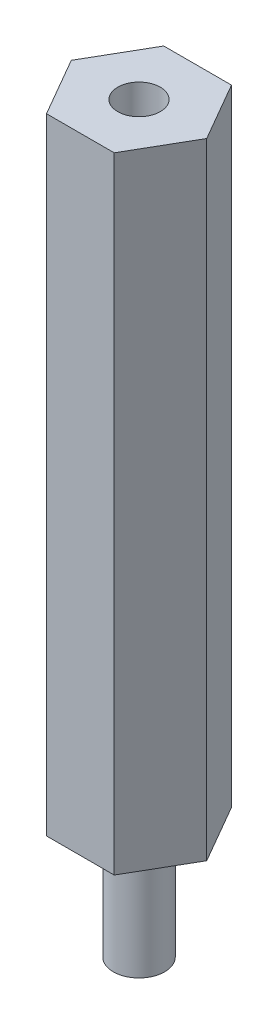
from build123d import *

# Parameters (mm, degrees)
BASE_EXTRUDE_DEPTH        = 50.8
SKETCH2_R                 = 2.0828
EXTRUDE1_DEPTH            = 9.525
F_8_32_TAPPED_HOLE1_D     = 3.4544
F_8_32_TAPPED_HOLE1_DEPTH = 13.8684
F_8_32_TAPPED_HOLE1_TIP   = 1.037806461


with BuildPart() as part:
    # Sketch1 → Base-Extrude (new body)
    with BuildSketch(Plane(origin=(0, 0, 0), x_dir=(1, 0, 0), z_dir=(0, 1, 0))):
        Polygon((5.499261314, 0), (2.749630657, 4.7625), (-2.749630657, 4.7625), (-5.499261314, 0), (-2.749630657, -4.7625), (2.749630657, -4.7625), align=None)
    extrude(amount=BASE_EXTRUDE_DEPTH)

    # Sketch2 → Extrude1 (add)
    with BuildSketch(Plane.XZ):
        with Locations(Location((0, 0, 0), (0, 0, 90))):
            Circle(SKETCH2_R)
    extrude(amount=EXTRUDE1_DEPTH)

    # 8-32 Tapped Hole1
    with Locations(Plane(origin=(0, 50.8, 0), x_dir=(-1, 0, 0), z_dir=(0, 1, 0))):
        with Locations((0, 0)):
            Hole(F_8_32_TAPPED_HOLE1_D / 2, depth=F_8_32_TAPPED_HOLE1_DEPTH)
            with Locations((0, 0, -(F_8_32_TAPPED_HOLE1_DEPTH + F_8_32_TAPPED_HOLE1_TIP / 2))):  # 118° drill point
                Cone(0, F_8_32_TAPPED_HOLE1_D / 2, F_8_32_TAPPED_HOLE1_TIP, mode=Mode.SUBTRACT)


solid = part.part
